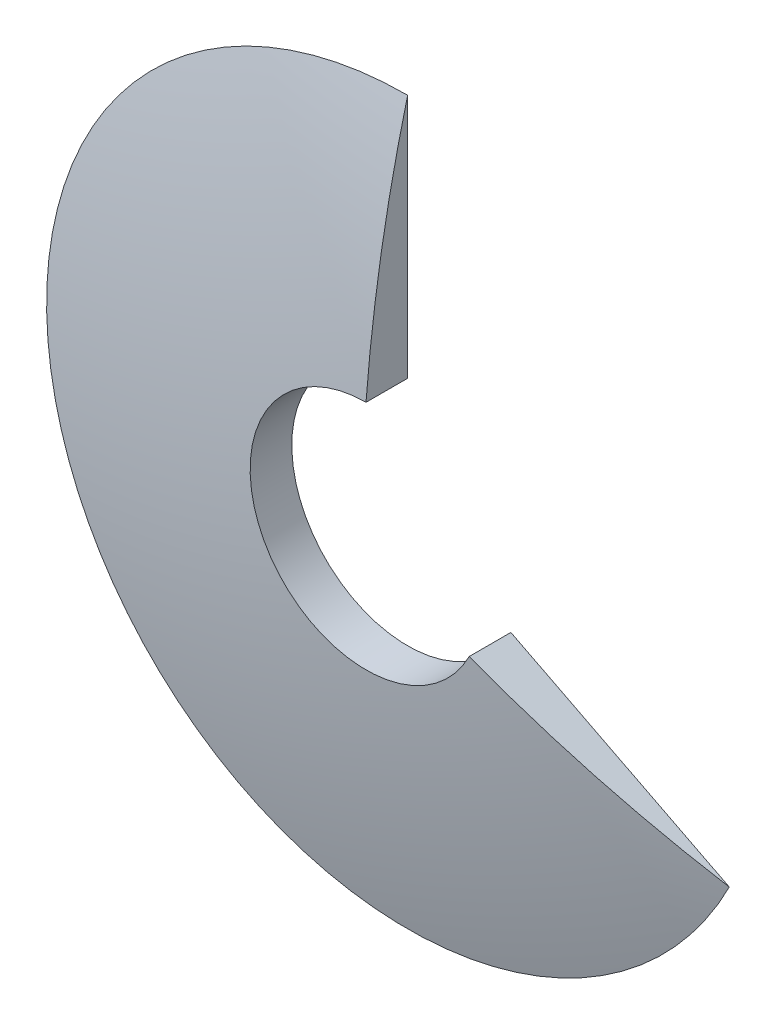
ISO-10303-21;
HEADER;
FILE_DESCRIPTION(('STEP AP214'),'2;1');
FILE_NAME('part.step','',(''),(''),'','','');
FILE_SCHEMA(('AUTOMOTIVE_DESIGN { 1 0 10303 214 1 1 1 1 }'));
ENDSEC;
DATA;
#1=APPLICATION_CONTEXT('core data for automotive mechanical design processes');
#2=APPLICATION_PROTOCOL_DEFINITION('international standard','automotive_design',2000,#1);
#3=PRODUCT_CONTEXT('',#1,'mechanical');
#4=PRODUCT('Part','Part','',(#3));
#5=PRODUCT_RELATED_PRODUCT_CATEGORY('part','',(#4));
#6=PRODUCT_DEFINITION_FORMATION('','',#4);
#7=PRODUCT_DEFINITION_CONTEXT('part definition',#1,'design');
#8=PRODUCT_DEFINITION('design','',#6,#7);
#9=PRODUCT_DEFINITION_SHAPE('','',#8);
#10=(LENGTH_UNIT() NAMED_UNIT(*) SI_UNIT(.MILLI.,.METRE.));
#11=(NAMED_UNIT(*) PLANE_ANGLE_UNIT() SI_UNIT($,.RADIAN.));
#12=(NAMED_UNIT(*) SI_UNIT($,.STERADIAN.) SOLID_ANGLE_UNIT());
#13=UNCERTAINTY_MEASURE_WITH_UNIT(LENGTH_MEASURE(1.E-05),#10,'distance_accuracy_value','');
#14=(GEOMETRIC_REPRESENTATION_CONTEXT(3) GLOBAL_UNCERTAINTY_ASSIGNED_CONTEXT((#13)) GLOBAL_UNIT_ASSIGNED_CONTEXT((#10,
#11,#12)) REPRESENTATION_CONTEXT('',''));
#15=CARTESIAN_POINT('',(0.,0.,0.));
#16=DIRECTION('',(0.,0.,1.));
#17=DIRECTION('',(1.,0.,0.));
#18=AXIS2_PLACEMENT_3D('',#15,#16,#17);
#19=CARTESIAN_POINT('',(0.,0.,0.));
#20=DIRECTION('',(0.,0.,1.));
#21=DIRECTION('',(1.,0.,0.));
#22=AXIS2_PLACEMENT_3D('',#19,#20,#21);
#23=PLANE('',#22);
#24=DIRECTION('',(0.891006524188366,-0.453990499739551,0.));
#25=VECTOR('',#24,1.);
#26=CARTESIAN_POINT('',(0.,0.,0.));
#27=LINE('',#26,#25);
#28=CARTESIAN_POINT('',(14.5902318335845,-7.43409443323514,0.));
#29=VERTEX_POINT('',#28);
#30=CARTESIAN_POINT('',(45.4631623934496,-23.1646382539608,0.));
#31=VERTEX_POINT('',#30);
#32=EDGE_CURVE('E65',#29,#31,#27,.T.);
#33=ORIENTED_EDGE('',*,*,#32,.T.);
#34=CARTESIAN_POINT('',(0.,0.,0.));
#35=DIRECTION('',(0.,0.,-1.));
#36=DIRECTION('',(-1.,0.,0.));
#37=AXIS2_PLACEMENT_3D('',#34,#35,#36);
#38=CIRCLE('',#37,51.0245);
#39=CARTESIAN_POINT('',(0.,51.0245,0.));
#40=VERTEX_POINT('',#39);
#41=EDGE_CURVE('E80',#31,#40,#38,.T.);
#42=ORIENTED_EDGE('',*,*,#41,.T.);
#43=DIRECTION('',(0.,1.,0.));
#44=VECTOR('',#43,1.);
#45=CARTESIAN_POINT('',(0.,0.,0.));
#46=LINE('',#45,#44);
#47=CARTESIAN_POINT('',(0.,16.375,0.));
#48=VERTEX_POINT('',#47);
#49=EDGE_CURVE('E48',#48,#40,#46,.T.);
#50=ORIENTED_EDGE('',*,*,#49,.F.);
#51=CARTESIAN_POINT('',(0.,0.,0.));
#52=DIRECTION('',(0.,0.,1.));
#53=DIRECTION('',(1.,0.,0.));
#54=AXIS2_PLACEMENT_3D('',#51,#52,#53);
#55=CIRCLE('',#54,16.375);
#56=EDGE_CURVE('E77',#48,#29,#55,.T.);
#57=ORIENTED_EDGE('',*,*,#56,.T.);
#58=EDGE_LOOP('',(#33,#42,#50,#57));
#59=FACE_BOUND('',#58,.T.);
#60=ADVANCED_FACE('F34',(#59),#23,.F.);
#61=CARTESIAN_POINT('',(0.,0.,6.55));
#62=DIRECTION('',(0.,0.,-1.));
#63=DIRECTION('',(-1.,0.,0.));
#64=AXIS2_PLACEMENT_3D('',#61,#62,#63);
#65=CYLINDRICAL_SURFACE('',#64,16.375);
#66=CARTESIAN_POINT('',(0.,0.,5.88524253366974));
#67=DIRECTION('',(0.,0.,-1.));
#68=DIRECTION('',(-1.,0.,0.));
#69=AXIS2_PLACEMENT_3D('',#66,#67,#68);
#70=CIRCLE('',#69,16.375);
#71=CARTESIAN_POINT('',(14.5902318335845,-7.43409443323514,5.88524253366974));
#72=VERTEX_POINT('',#71);
#73=CARTESIAN_POINT('',(0.,16.3750000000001,5.88524253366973));
#74=VERTEX_POINT('',#73);
#75=EDGE_CURVE('E79',#72,#74,#70,.T.);
#76=ORIENTED_EDGE('',*,*,#75,.F.);
#77=DIRECTION('',(0.,0.,-1.));
#78=VECTOR('',#77,1.);
#79=CARTESIAN_POINT('',(14.5902318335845,-7.43409443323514,6.55));
#80=LINE('',#79,#78);
#81=EDGE_CURVE('E55',#72,#29,#80,.T.);
#82=ORIENTED_EDGE('',*,*,#81,.T.);
#83=ORIENTED_EDGE('',*,*,#56,.F.);
#84=DIRECTION('',(0.,0.,-1.));
#85=VECTOR('',#84,1.);
#86=CARTESIAN_POINT('',(0.,16.375,6.55));
#87=LINE('',#86,#85);
#88=EDGE_CURVE('E81',#74,#48,#87,.T.);
#89=ORIENTED_EDGE('',*,*,#88,.F.);
#90=EDGE_LOOP('',(#76,#82,#83,#89));
#91=FACE_BOUND('',#90,.T.);
#92=ADVANCED_FACE('F75',(#91),#65,.F.);
#93=CARTESIAN_POINT('',(0.,0.,-195.465427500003));
#94=DIRECTION('',(0.,0.,-1.));
#95=DIRECTION('',(0.,1.,0.));
#96=AXIS2_PLACEMENT_3D('',#93,#94,#95);
#97=SPHERICAL_SURFACE('',#96,202.015427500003);
#98=CARTESIAN_POINT('',(0.,0.,-195.465427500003));
#99=DIRECTION('',(0.453990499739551,0.891006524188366,0.));
#100=DIRECTION('',(-0.891006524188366,0.453990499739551,0.));
#101=AXIS2_PLACEMENT_3D('',#98,#99,#100);
#102=CIRCLE('',#101,202.015427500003);
#103=EDGE_CURVE('E11',#72,#31,#102,.T.);
#104=ORIENTED_EDGE('',*,*,#103,.F.);
#105=ORIENTED_EDGE('',*,*,#75,.T.);
#106=CARTESIAN_POINT('',(0.,0.,-195.465427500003));
#107=DIRECTION('',(-1.,0.,0.));
#108=DIRECTION('',(0.,0.,1.));
#109=AXIS2_PLACEMENT_3D('',#106,#107,#108);
#110=CIRCLE('',#109,202.015427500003);
#111=EDGE_CURVE('E41',#74,#40,#110,.T.);
#112=ORIENTED_EDGE('',*,*,#111,.T.);
#113=ORIENTED_EDGE('',*,*,#41,.F.);
#114=EDGE_LOOP('',(#104,#105,#112,#113));
#115=FACE_BOUND('',#114,.T.);
#116=ADVANCED_FACE('F90',(#115),#97,.T.);
#117=CARTESIAN_POINT('',(0.,0.,5.88524253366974));
#118=DIRECTION('',(-1.,0.,0.));
#119=DIRECTION('',(0.,0.,1.));
#120=AXIS2_PLACEMENT_3D('',#117,#118,#119);
#121=PLANE('',#120);
#122=ORIENTED_EDGE('',*,*,#88,.T.);
#123=ORIENTED_EDGE('',*,*,#49,.T.);
#124=ORIENTED_EDGE('',*,*,#111,.F.);
#125=EDGE_LOOP('',(#122,#123,#124));
#126=FACE_BOUND('',#125,.T.);
#127=ADVANCED_FACE('F88',(#126),#121,.F.);
#128=CARTESIAN_POINT('',(0.,0.,5.88524253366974));
#129=DIRECTION('',(0.453990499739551,0.891006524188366,0.));
#130=DIRECTION('',(-0.891006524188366,0.453990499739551,0.));
#131=AXIS2_PLACEMENT_3D('',#128,#129,#130);
#132=PLANE('',#131);
#133=ORIENTED_EDGE('',*,*,#103,.T.);
#134=ORIENTED_EDGE('',*,*,#32,.F.);
#135=ORIENTED_EDGE('',*,*,#81,.F.);
#136=EDGE_LOOP('',(#133,#134,#135));
#137=FACE_BOUND('',#136,.T.);
#138=ADVANCED_FACE('F66',(#137),#132,.T.);
#139=CLOSED_SHELL('',(#60,#92,#116,#127,#138));
#140=MANIFOLD_SOLID_BREP('B2',#139);
#141=ADVANCED_BREP_SHAPE_REPRESENTATION('',(#18,#140),#14);
#142=SHAPE_DEFINITION_REPRESENTATION(#9,#141);
ENDSEC;
END-ISO-10303-21;
